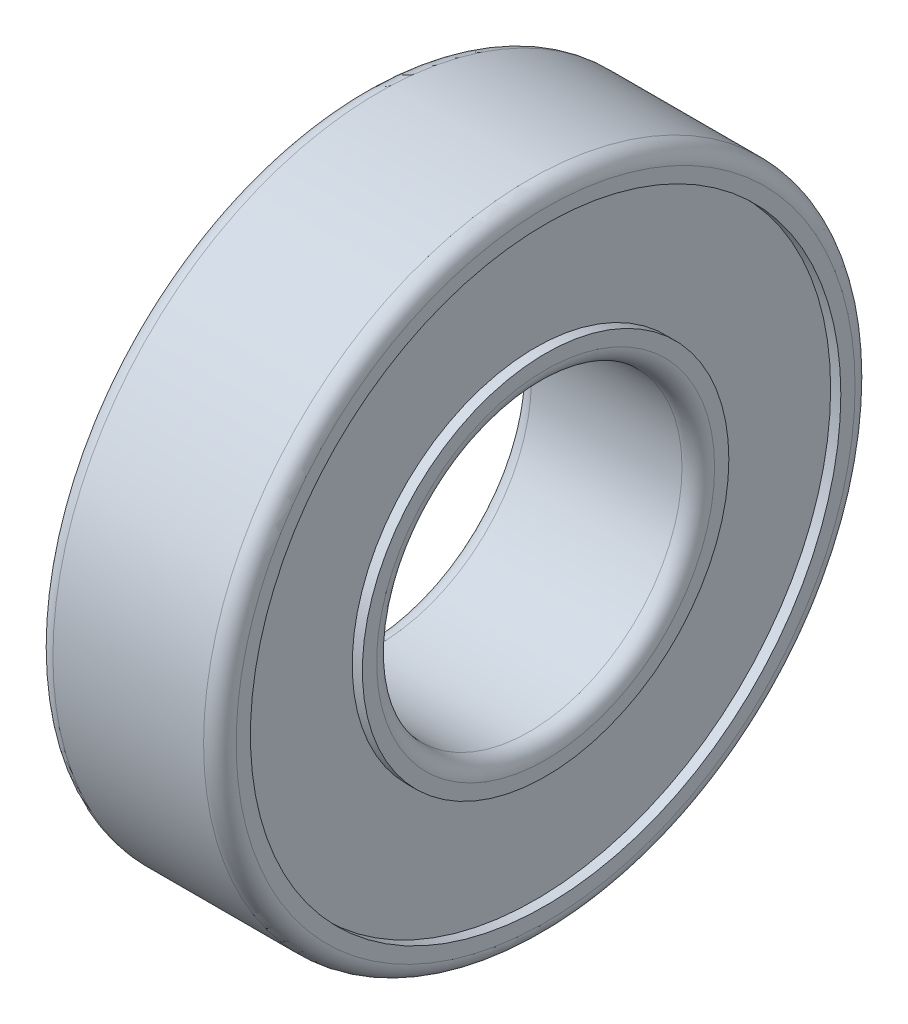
ISO-10303-21;
HEADER;
FILE_DESCRIPTION(('STEP AP214'),'2;1');
FILE_NAME('part.step','',(''),(''),'','','');
FILE_SCHEMA(('AUTOMOTIVE_DESIGN { 1 0 10303 214 1 1 1 1 }'));
ENDSEC;
DATA;
#1=APPLICATION_CONTEXT('core data for automotive mechanical design processes');
#2=APPLICATION_PROTOCOL_DEFINITION('international standard','automotive_design',2000,#1);
#3=PRODUCT_CONTEXT('',#1,'mechanical');
#4=PRODUCT('Part','Part','',(#3));
#5=PRODUCT_RELATED_PRODUCT_CATEGORY('part','',(#4));
#6=PRODUCT_DEFINITION_FORMATION('','',#4);
#7=PRODUCT_DEFINITION_CONTEXT('part definition',#1,'design');
#8=PRODUCT_DEFINITION('design','',#6,#7);
#9=PRODUCT_DEFINITION_SHAPE('','',#8);
#10=(LENGTH_UNIT() NAMED_UNIT(*) SI_UNIT(.MILLI.,.METRE.));
#11=(NAMED_UNIT(*) PLANE_ANGLE_UNIT() SI_UNIT($,.RADIAN.));
#12=(NAMED_UNIT(*) SI_UNIT($,.STERADIAN.) SOLID_ANGLE_UNIT());
#13=UNCERTAINTY_MEASURE_WITH_UNIT(LENGTH_MEASURE(1.E-05),#10,'distance_accuracy_value','');
#14=(GEOMETRIC_REPRESENTATION_CONTEXT(3) GLOBAL_UNCERTAINTY_ASSIGNED_CONTEXT((#13)) GLOBAL_UNIT_ASSIGNED_CONTEXT((#10,
#11,#12)) REPRESENTATION_CONTEXT('',''));
#15=CARTESIAN_POINT('',(0.,0.,0.));
#16=DIRECTION('',(0.,0.,1.));
#17=DIRECTION('',(1.,0.,0.));
#18=AXIS2_PLACEMENT_3D('',#15,#16,#17);
#19=CARTESIAN_POINT('',(-4.5,7.5,0.));
#20=DIRECTION('',(-1.,0.,0.));
#21=DIRECTION('',(0.,0.,1.));
#22=AXIS2_PLACEMENT_3D('',#19,#20,#21);
#23=PLANE('',#22);
#24=CARTESIAN_POINT('',(-4.5,0.,0.));
#25=DIRECTION('',(-1.,0.,0.));
#26=DIRECTION('',(0.,0.,1.));
#27=AXIS2_PLACEMENT_3D('',#24,#25,#26);
#28=CIRCLE('',#27,8.3);
#29=CARTESIAN_POINT('',(-4.5,0.,8.3));
#30=VERTEX_POINT('',#29);
#31=EDGE_CURVE('E50',#30,#30,#28,.F.);
#32=ORIENTED_EDGE('',*,*,#31,.T.);
#33=EDGE_LOOP('',(#32));
#34=FACE_BOUND('',#33,.T.);
#35=CARTESIAN_POINT('',(-4.5,0.,0.));
#36=DIRECTION('',(1.,0.,0.));
#37=DIRECTION('',(0.,0.,-1.));
#38=AXIS2_PLACEMENT_3D('',#35,#36,#37);
#39=CIRCLE('',#38,9.);
#40=CARTESIAN_POINT('',(-4.5,0.,-9.));
#41=VERTEX_POINT('',#40);
#42=EDGE_CURVE('E88',#41,#41,#39,.T.);
#43=ORIENTED_EDGE('',*,*,#42,.F.);
#44=EDGE_LOOP('',(#43));
#45=FACE_BOUND('',#44,.T.);
#46=ADVANCED_FACE('F35',(#34,#45),#23,.T.);
#47=CARTESIAN_POINT('',(0.,0.,0.));
#48=DIRECTION('',(1.,0.,0.));
#49=DIRECTION('',(0.,0.,-1.));
#50=AXIS2_PLACEMENT_3D('',#47,#48,#49);
#51=CYLINDRICAL_SURFACE('',#50,7.5);
#52=CARTESIAN_POINT('',(-3.7,0.,0.));
#53=DIRECTION('',(-1.,0.,0.));
#54=DIRECTION('',(0.,0.,1.));
#55=AXIS2_PLACEMENT_3D('',#52,#53,#54);
#56=CIRCLE('',#55,7.5);
#57=CARTESIAN_POINT('',(-3.7,0.,7.5));
#58=VERTEX_POINT('',#57);
#59=EDGE_CURVE('E42',#58,#58,#56,.T.);
#60=ORIENTED_EDGE('',*,*,#59,.T.);
#61=EDGE_LOOP('',(#60));
#62=FACE_BOUND('',#61,.T.);
#63=CARTESIAN_POINT('',(3.7,0.,0.));
#64=DIRECTION('',(1.,0.,0.));
#65=DIRECTION('',(0.,0.,-1.));
#66=AXIS2_PLACEMENT_3D('',#63,#64,#65);
#67=CIRCLE('',#66,7.5);
#68=CARTESIAN_POINT('',(3.7,0.,-7.5));
#69=VERTEX_POINT('',#68);
#70=EDGE_CURVE('E46',#69,#69,#67,.T.);
#71=ORIENTED_EDGE('',*,*,#70,.T.);
#72=EDGE_LOOP('',(#71));
#73=FACE_BOUND('',#72,.T.);
#74=ADVANCED_FACE('F96',(#62,#73),#51,.F.);
#75=CARTESIAN_POINT('',(4.5,7.5,0.));
#76=DIRECTION('',(1.,0.,0.));
#77=DIRECTION('',(0.,0.,-1.));
#78=AXIS2_PLACEMENT_3D('',#75,#76,#77);
#79=PLANE('',#78);
#80=CARTESIAN_POINT('',(4.5,0.,0.));
#81=DIRECTION('',(1.,0.,0.));
#82=DIRECTION('',(0.,0.,-1.));
#83=AXIS2_PLACEMENT_3D('',#80,#81,#82);
#84=CIRCLE('',#83,8.3);
#85=CARTESIAN_POINT('',(4.5,0.,-8.3));
#86=VERTEX_POINT('',#85);
#87=EDGE_CURVE('E10',#86,#86,#84,.F.);
#88=ORIENTED_EDGE('',*,*,#87,.T.);
#89=EDGE_LOOP('',(#88));
#90=FACE_BOUND('',#89,.T.);
#91=CARTESIAN_POINT('',(4.5,0.,0.));
#92=DIRECTION('',(1.,0.,0.));
#93=DIRECTION('',(0.,0.,-1.));
#94=AXIS2_PLACEMENT_3D('',#91,#92,#93);
#95=CIRCLE('',#94,9.);
#96=CARTESIAN_POINT('',(4.5,0.,-9.));
#97=VERTEX_POINT('',#96);
#98=EDGE_CURVE('E67',#97,#97,#95,.T.);
#99=ORIENTED_EDGE('',*,*,#98,.T.);
#100=EDGE_LOOP('',(#99));
#101=FACE_BOUND('',#100,.T.);
#102=ADVANCED_FACE('F102',(#90,#101),#79,.T.);
#103=CARTESIAN_POINT('',(0.,0.,0.));
#104=DIRECTION('',(1.,0.,0.));
#105=DIRECTION('',(0.,0.,-1.));
#106=AXIS2_PLACEMENT_3D('',#103,#104,#105);
#107=CYLINDRICAL_SURFACE('',#106,9.);
#108=CARTESIAN_POINT('',(4.,0.,0.));
#109=DIRECTION('',(1.,0.,0.));
#110=DIRECTION('',(0.,0.,-1.));
#111=AXIS2_PLACEMENT_3D('',#108,#109,#110);
#112=CIRCLE('',#111,9.);
#113=CARTESIAN_POINT('',(4.,0.,-9.));
#114=VERTEX_POINT('',#113);
#115=EDGE_CURVE('E70',#114,#114,#112,.T.);
#116=ORIENTED_EDGE('',*,*,#115,.T.);
#117=EDGE_LOOP('',(#116));
#118=FACE_BOUND('',#117,.T.);
#119=ORIENTED_EDGE('',*,*,#98,.F.);
#120=EDGE_LOOP('',(#119));
#121=FACE_BOUND('',#120,.T.);
#122=ADVANCED_FACE('F190',(#118,#121),#107,.T.);
#123=CARTESIAN_POINT('',(4.,9.,0.));
#124=DIRECTION('',(1.,0.,0.));
#125=DIRECTION('',(0.,0.,-1.));
#126=AXIS2_PLACEMENT_3D('',#123,#124,#125);
#127=PLANE('',#126);
#128=CARTESIAN_POINT('',(4.,0.,0.));
#129=DIRECTION('',(1.,0.,0.));
#130=DIRECTION('',(0.,0.,-1.));
#131=AXIS2_PLACEMENT_3D('',#128,#129,#130);
#132=CIRCLE('',#131,14.5);
#133=CARTESIAN_POINT('',(4.,0.,-14.5));
#134=VERTEX_POINT('',#133);
#135=EDGE_CURVE('E73',#134,#134,#132,.T.);
#136=ORIENTED_EDGE('',*,*,#135,.T.);
#137=EDGE_LOOP('',(#136));
#138=FACE_BOUND('',#137,.T.);
#139=ORIENTED_EDGE('',*,*,#115,.F.);
#140=EDGE_LOOP('',(#139));
#141=FACE_BOUND('',#140,.T.);
#142=ADVANCED_FACE('F233',(#138,#141),#127,.T.);
#143=CARTESIAN_POINT('',(0.,0.,0.));
#144=DIRECTION('',(1.,0.,0.));
#145=DIRECTION('',(0.,0.,-1.));
#146=AXIS2_PLACEMENT_3D('',#143,#144,#145);
#147=CYLINDRICAL_SURFACE('',#146,14.5);
#148=CARTESIAN_POINT('',(4.5,0.,0.));
#149=DIRECTION('',(1.,0.,0.));
#150=DIRECTION('',(0.,0.,-1.));
#151=AXIS2_PLACEMENT_3D('',#148,#149,#150);
#152=CIRCLE('',#151,14.5);
#153=CARTESIAN_POINT('',(4.5,0.,-14.5));
#154=VERTEX_POINT('',#153);
#155=EDGE_CURVE('E76',#154,#154,#152,.T.);
#156=ORIENTED_EDGE('',*,*,#155,.T.);
#157=EDGE_LOOP('',(#156));
#158=FACE_BOUND('',#157,.T.);
#159=ORIENTED_EDGE('',*,*,#135,.F.);
#160=EDGE_LOOP('',(#159));
#161=FACE_BOUND('',#160,.T.);
#162=ADVANCED_FACE('F178',(#158,#161),#147,.F.);
#163=CARTESIAN_POINT('',(4.5,14.5,0.));
#164=DIRECTION('',(1.,0.,0.));
#165=DIRECTION('',(0.,0.,-1.));
#166=AXIS2_PLACEMENT_3D('',#163,#164,#165);
#167=PLANE('',#166);
#168=CARTESIAN_POINT('',(4.5,0.,0.));
#169=DIRECTION('',(1.,0.,0.));
#170=DIRECTION('',(0.,0.,-1.));
#171=AXIS2_PLACEMENT_3D('',#168,#169,#170);
#172=CIRCLE('',#171,15.2);
#173=CARTESIAN_POINT('',(4.5,0.,-15.2));
#174=VERTEX_POINT('',#173);
#175=EDGE_CURVE('E64',#174,#174,#172,.T.);
#176=ORIENTED_EDGE('',*,*,#175,.T.);
#177=EDGE_LOOP('',(#176));
#178=FACE_BOUND('',#177,.T.);
#179=ORIENTED_EDGE('',*,*,#155,.F.);
#180=EDGE_LOOP('',(#179));
#181=FACE_BOUND('',#180,.T.);
#182=ADVANCED_FACE('F168',(#178,#181),#167,.T.);
#183=CARTESIAN_POINT('',(0.,0.,0.));
#184=DIRECTION('',(1.,0.,0.));
#185=DIRECTION('',(0.,0.,-1.));
#186=AXIS2_PLACEMENT_3D('',#183,#184,#185);
#187=CYLINDRICAL_SURFACE('',#186,16.);
#188=CARTESIAN_POINT('',(3.7,0.,0.));
#189=DIRECTION('',(1.,0.,0.));
#190=DIRECTION('',(0.,0.,-1.));
#191=AXIS2_PLACEMENT_3D('',#188,#189,#190);
#192=CIRCLE('',#191,16.);
#193=CARTESIAN_POINT('',(3.7,0.,-16.));
#194=VERTEX_POINT('',#193);
#195=EDGE_CURVE('E58',#194,#194,#192,.F.);
#196=ORIENTED_EDGE('',*,*,#195,.T.);
#197=EDGE_LOOP('',(#196));
#198=FACE_BOUND('',#197,.T.);
#199=CARTESIAN_POINT('',(-3.7,0.,0.));
#200=DIRECTION('',(-1.,0.,0.));
#201=DIRECTION('',(0.,0.,1.));
#202=AXIS2_PLACEMENT_3D('',#199,#200,#201);
#203=CIRCLE('',#202,16.);
#204=CARTESIAN_POINT('',(-3.7,0.,16.));
#205=VERTEX_POINT('',#204);
#206=EDGE_CURVE('E61',#205,#205,#203,.F.);
#207=ORIENTED_EDGE('',*,*,#206,.T.);
#208=EDGE_LOOP('',(#207));
#209=FACE_BOUND('',#208,.T.);
#210=ADVANCED_FACE('F156',(#198,#209),#187,.T.);
#211=CARTESIAN_POINT('',(-4.5,14.5,0.));
#212=DIRECTION('',(-1.,0.,0.));
#213=DIRECTION('',(0.,0.,1.));
#214=AXIS2_PLACEMENT_3D('',#211,#212,#213);
#215=PLANE('',#214);
#216=CARTESIAN_POINT('',(-4.5,0.,0.));
#217=DIRECTION('',(-1.,0.,0.));
#218=DIRECTION('',(0.,0.,1.));
#219=AXIS2_PLACEMENT_3D('',#216,#217,#218);
#220=CIRCLE('',#219,15.2);
#221=CARTESIAN_POINT('',(-4.5,0.,15.2));
#222=VERTEX_POINT('',#221);
#223=EDGE_CURVE('E55',#222,#222,#220,.T.);
#224=ORIENTED_EDGE('',*,*,#223,.T.);
#225=EDGE_LOOP('',(#224));
#226=FACE_BOUND('',#225,.T.);
#227=CARTESIAN_POINT('',(-4.5,0.,0.));
#228=DIRECTION('',(1.,0.,0.));
#229=DIRECTION('',(0.,0.,-1.));
#230=AXIS2_PLACEMENT_3D('',#227,#228,#229);
#231=CIRCLE('',#230,14.5);
#232=CARTESIAN_POINT('',(-4.5,0.,-14.5));
#233=VERTEX_POINT('',#232);
#234=EDGE_CURVE('E79',#233,#233,#231,.T.);
#235=ORIENTED_EDGE('',*,*,#234,.T.);
#236=EDGE_LOOP('',(#235));
#237=FACE_BOUND('',#236,.T.);
#238=ADVANCED_FACE('F150',(#226,#237),#215,.T.);
#239=CARTESIAN_POINT('',(0.,0.,0.));
#240=DIRECTION('',(1.,0.,0.));
#241=DIRECTION('',(0.,0.,-1.));
#242=AXIS2_PLACEMENT_3D('',#239,#240,#241);
#243=CYLINDRICAL_SURFACE('',#242,14.5);
#244=CARTESIAN_POINT('',(-4.,0.,0.));
#245=DIRECTION('',(1.,0.,0.));
#246=DIRECTION('',(0.,0.,-1.));
#247=AXIS2_PLACEMENT_3D('',#244,#245,#246);
#248=CIRCLE('',#247,14.5);
#249=CARTESIAN_POINT('',(-4.,0.,-14.5));
#250=VERTEX_POINT('',#249);
#251=EDGE_CURVE('E82',#250,#250,#248,.T.);
#252=ORIENTED_EDGE('',*,*,#251,.T.);
#253=EDGE_LOOP('',(#252));
#254=FACE_BOUND('',#253,.T.);
#255=ORIENTED_EDGE('',*,*,#234,.F.);
#256=EDGE_LOOP('',(#255));
#257=FACE_BOUND('',#256,.T.);
#258=ADVANCED_FACE('F155',(#254,#257),#243,.F.);
#259=CARTESIAN_POINT('',(-4.,9.,0.));
#260=DIRECTION('',(-1.,0.,0.));
#261=DIRECTION('',(0.,0.,1.));
#262=AXIS2_PLACEMENT_3D('',#259,#260,#261);
#263=PLANE('',#262);
#264=CARTESIAN_POINT('',(-4.,0.,0.));
#265=DIRECTION('',(1.,0.,0.));
#266=DIRECTION('',(0.,0.,-1.));
#267=AXIS2_PLACEMENT_3D('',#264,#265,#266);
#268=CIRCLE('',#267,9.);
#269=CARTESIAN_POINT('',(-4.,0.,-9.));
#270=VERTEX_POINT('',#269);
#271=EDGE_CURVE('E85',#270,#270,#268,.T.);
#272=ORIENTED_EDGE('',*,*,#271,.T.);
#273=EDGE_LOOP('',(#272));
#274=FACE_BOUND('',#273,.T.);
#275=ORIENTED_EDGE('',*,*,#251,.F.);
#276=EDGE_LOOP('',(#275));
#277=FACE_BOUND('',#276,.T.);
#278=ADVANCED_FACE('F208',(#274,#277),#263,.T.);
#279=CARTESIAN_POINT('',(0.,0.,0.));
#280=DIRECTION('',(1.,0.,0.));
#281=DIRECTION('',(0.,0.,-1.));
#282=AXIS2_PLACEMENT_3D('',#279,#280,#281);
#283=CYLINDRICAL_SURFACE('',#282,9.);
#284=ORIENTED_EDGE('',*,*,#42,.T.);
#285=EDGE_LOOP('',(#284));
#286=FACE_BOUND('',#285,.T.);
#287=ORIENTED_EDGE('',*,*,#271,.F.);
#288=EDGE_LOOP('',(#287));
#289=FACE_BOUND('',#288,.T.);
#290=ADVANCED_FACE('F92',(#286,#289),#283,.T.);
#291=CARTESIAN_POINT('',(3.7,0.,0.));
#292=DIRECTION('',(1.,0.,0.));
#293=DIRECTION('',(0.,0.,-1.));
#294=AXIS2_PLACEMENT_3D('',#291,#292,#293);
#295=TOROIDAL_SURFACE('',#294,15.2,0.8);
#296=ORIENTED_EDGE('',*,*,#195,.F.);
#297=EDGE_LOOP('',(#296));
#298=FACE_BOUND('',#297,.T.);
#299=ORIENTED_EDGE('',*,*,#175,.F.);
#300=EDGE_LOOP('',(#299));
#301=FACE_BOUND('',#300,.T.);
#302=ADVANCED_FACE('F106',(#298,#301),#295,.T.);
#303=CARTESIAN_POINT('',(-3.7,0.,0.));
#304=DIRECTION('',(-1.,0.,0.));
#305=DIRECTION('',(0.,0.,1.));
#306=AXIS2_PLACEMENT_3D('',#303,#304,#305);
#307=TOROIDAL_SURFACE('',#306,15.2,0.8);
#308=ORIENTED_EDGE('',*,*,#223,.F.);
#309=EDGE_LOOP('',(#308));
#310=FACE_BOUND('',#309,.T.);
#311=ORIENTED_EDGE('',*,*,#206,.F.);
#312=EDGE_LOOP('',(#311));
#313=FACE_BOUND('',#312,.T.);
#314=ADVANCED_FACE('F109',(#310,#313),#307,.T.);
#315=CARTESIAN_POINT('',(-3.7,0.,0.));
#316=DIRECTION('',(-1.,0.,0.));
#317=DIRECTION('',(0.,0.,1.));
#318=AXIS2_PLACEMENT_3D('',#315,#316,#317);
#319=TOROIDAL_SURFACE('',#318,8.3,0.8);
#320=ORIENTED_EDGE('',*,*,#59,.F.);
#321=EDGE_LOOP('',(#320));
#322=FACE_BOUND('',#321,.T.);
#323=ORIENTED_EDGE('',*,*,#31,.F.);
#324=EDGE_LOOP('',(#323));
#325=FACE_BOUND('',#324,.T.);
#326=ADVANCED_FACE('F112',(#322,#325),#319,.T.);
#327=CARTESIAN_POINT('',(3.7,0.,0.));
#328=DIRECTION('',(1.,0.,0.));
#329=DIRECTION('',(0.,0.,-1.));
#330=AXIS2_PLACEMENT_3D('',#327,#328,#329);
#331=TOROIDAL_SURFACE('',#330,8.3,0.8);
#332=ORIENTED_EDGE('',*,*,#87,.F.);
#333=EDGE_LOOP('',(#332));
#334=FACE_BOUND('',#333,.T.);
#335=ORIENTED_EDGE('',*,*,#70,.F.);
#336=EDGE_LOOP('',(#335));
#337=FACE_BOUND('',#336,.T.);
#338=ADVANCED_FACE('F37',(#334,#337),#331,.T.);
#339=CLOSED_SHELL('',(#46,#74,#102,#122,#142,#162,#182,#210,#238,#258,#278,#290,#302,#314,#326,#338));
#340=MANIFOLD_SOLID_BREP('B2',#339);
#341=ADVANCED_BREP_SHAPE_REPRESENTATION('',(#18,#340),#14);
#342=SHAPE_DEFINITION_REPRESENTATION(#9,#341);
ENDSEC;
END-ISO-10303-21;
